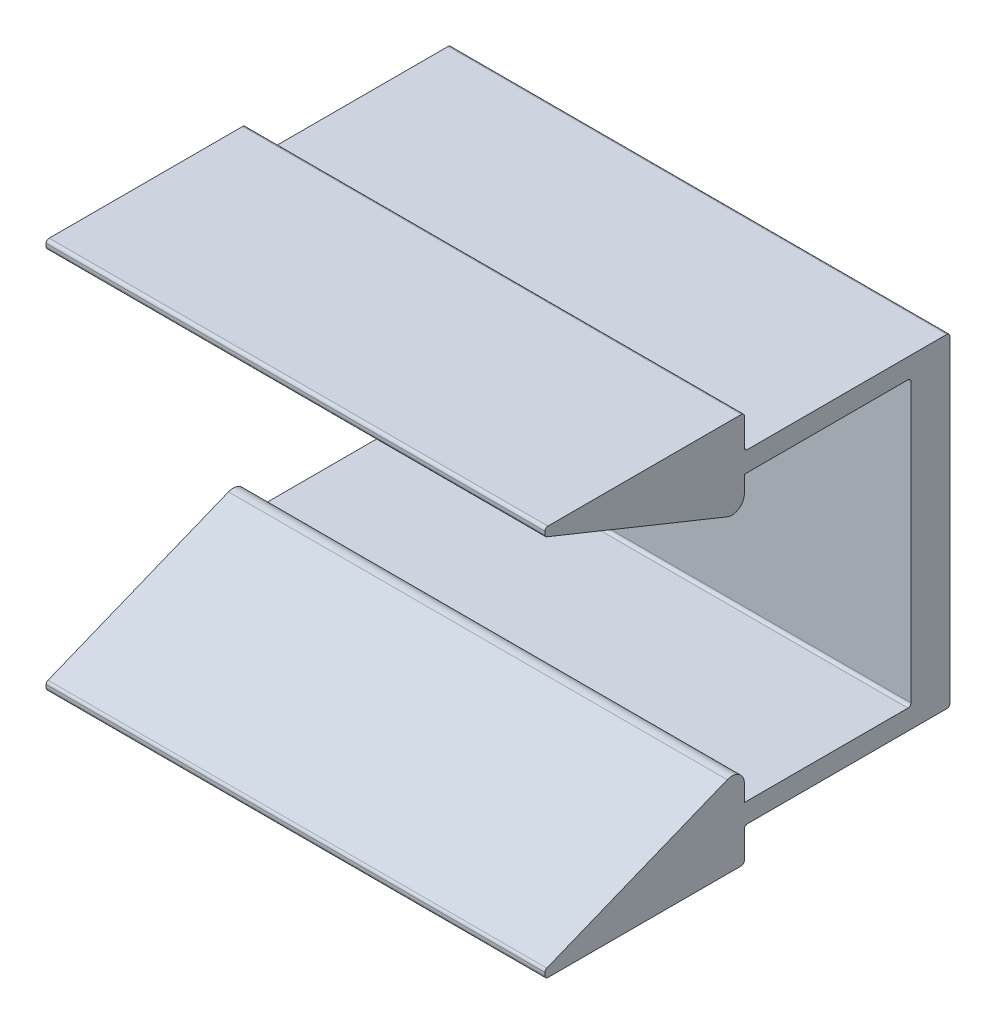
ISO-10303-21;
HEADER;
FILE_DESCRIPTION(('STEP AP214'),'2;1');
FILE_NAME('part.step','',(''),(''),'','','');
FILE_SCHEMA(('AUTOMOTIVE_DESIGN { 1 0 10303 214 1 1 1 1 }'));
ENDSEC;
DATA;
#1=APPLICATION_CONTEXT('core data for automotive mechanical design processes');
#2=APPLICATION_PROTOCOL_DEFINITION('international standard','automotive_design',2000,#1);
#3=PRODUCT_CONTEXT('',#1,'mechanical');
#4=PRODUCT('Part','Part','',(#3));
#5=PRODUCT_RELATED_PRODUCT_CATEGORY('part','',(#4));
#6=PRODUCT_DEFINITION_FORMATION('','',#4);
#7=PRODUCT_DEFINITION_CONTEXT('part definition',#1,'design');
#8=PRODUCT_DEFINITION('design','',#6,#7);
#9=PRODUCT_DEFINITION_SHAPE('','',#8);
#10=(LENGTH_UNIT() NAMED_UNIT(*) SI_UNIT(.MILLI.,.METRE.));
#11=(NAMED_UNIT(*) PLANE_ANGLE_UNIT() SI_UNIT($,.RADIAN.));
#12=(NAMED_UNIT(*) SI_UNIT($,.STERADIAN.) SOLID_ANGLE_UNIT());
#13=UNCERTAINTY_MEASURE_WITH_UNIT(LENGTH_MEASURE(1.E-05),#10,'distance_accuracy_value','');
#14=(GEOMETRIC_REPRESENTATION_CONTEXT(3) GLOBAL_UNCERTAINTY_ASSIGNED_CONTEXT((#13)) GLOBAL_UNIT_ASSIGNED_CONTEXT((#10,
#11,#12)) REPRESENTATION_CONTEXT('',''));
#15=CARTESIAN_POINT('',(0.,0.,0.));
#16=DIRECTION('',(0.,0.,1.));
#17=DIRECTION('',(1.,0.,0.));
#18=AXIS2_PLACEMENT_3D('',#15,#16,#17);
#19=CARTESIAN_POINT('',(31.75,17.7165,4.953));
#20=DIRECTION('',(0.,0.,-1.));
#21=DIRECTION('',(-1.,0.,0.));
#22=AXIS2_PLACEMENT_3D('',#19,#20,#21);
#23=PLANE('',#22);
#24=DIRECTION('',(0.,-1.,0.));
#25=VECTOR('',#24,1.);
#26=CARTESIAN_POINT('',(-31.75,17.7165,4.953));
#27=LINE('',#26,#25);
#28=CARTESIAN_POINT('',(-31.75,17.7165,4.953));
#29=VERTEX_POINT('',#28);
#30=CARTESIAN_POINT('',(-31.75,-17.7165,4.953));
#31=VERTEX_POINT('',#30);
#32=EDGE_CURVE('E218',#29,#31,#27,.T.);
#33=ORIENTED_EDGE('',*,*,#32,.T.);
#34=DIRECTION('',(-1.,0.,0.));
#35=VECTOR('',#34,1.);
#36=CARTESIAN_POINT('',(31.75,-17.7165,4.953));
#37=LINE('',#36,#35);
#38=CARTESIAN_POINT('',(31.75,-17.7165,4.953));
#39=VERTEX_POINT('',#38);
#40=EDGE_CURVE('E426',#39,#31,#37,.T.);
#41=ORIENTED_EDGE('',*,*,#40,.F.);
#42=DIRECTION('',(0.,-1.,0.));
#43=VECTOR('',#42,1.);
#44=CARTESIAN_POINT('',(31.75,17.7165,4.953));
#45=LINE('',#44,#43);
#46=CARTESIAN_POINT('',(31.75,17.7165,4.953));
#47=VERTEX_POINT('',#46);
#48=EDGE_CURVE('E293',#47,#39,#45,.T.);
#49=ORIENTED_EDGE('',*,*,#48,.F.);
#50=DIRECTION('',(-1.,0.,0.));
#51=VECTOR('',#50,1.);
#52=CARTESIAN_POINT('',(31.75,17.7165,4.953));
#53=LINE('',#52,#51);
#54=EDGE_CURVE('E23',#47,#29,#53,.T.);
#55=ORIENTED_EDGE('',*,*,#54,.T.);
#56=EDGE_LOOP('',(#33,#41,#49,#55));
#57=FACE_BOUND('',#56,.T.);
#58=CARTESIAN_POINT('',(0.,0.,4.953));
#59=DIRECTION('',(0.,0.,-1.));
#60=DIRECTION('',(-1.,0.,0.));
#61=AXIS2_PLACEMENT_3D('',#58,#59,#60);
#62=CIRCLE('',#61,8.255);
#63=CARTESIAN_POINT('',(-8.255,0.,4.953));
#64=VERTEX_POINT('',#63);
#65=EDGE_CURVE('E230',#64,#64,#62,.F.);
#66=ORIENTED_EDGE('',*,*,#65,.F.);
#67=EDGE_LOOP('',(#66));
#68=FACE_BOUND('',#67,.T.);
#69=ADVANCED_FACE('F14',(#57,#68),#23,.F.);
#70=CARTESIAN_POINT('',(31.75,-20.2565,0.));
#71=DIRECTION('',(0.,0.,1.));
#72=DIRECTION('',(1.,0.,0.));
#73=AXIS2_PLACEMENT_3D('',#70,#71,#72);
#74=PLANE('',#73);
#75=DIRECTION('',(0.,1.,0.));
#76=VECTOR('',#75,1.);
#77=CARTESIAN_POINT('',(-31.75,-20.2565,0.));
#78=LINE('',#77,#76);
#79=CARTESIAN_POINT('',(-31.75,-20.2565,0.));
#80=VERTEX_POINT('',#79);
#81=CARTESIAN_POINT('',(-31.75,20.2565,0.));
#82=VERTEX_POINT('',#81);
#83=EDGE_CURVE('E264',#80,#82,#78,.T.);
#84=ORIENTED_EDGE('',*,*,#83,.T.);
#85=DIRECTION('',(-1.,0.,0.));
#86=VECTOR('',#85,1.);
#87=CARTESIAN_POINT('',(31.75,20.2565,0.));
#88=LINE('',#87,#86);
#89=CARTESIAN_POINT('',(31.75,20.2565,0.));
#90=VERTEX_POINT('',#89);
#91=EDGE_CURVE('E381',#90,#82,#88,.T.);
#92=ORIENTED_EDGE('',*,*,#91,.F.);
#93=DIRECTION('',(0.,1.,0.));
#94=VECTOR('',#93,1.);
#95=CARTESIAN_POINT('',(31.75,-20.2565,0.));
#96=LINE('',#95,#94);
#97=CARTESIAN_POINT('',(31.75,-20.2565,0.));
#98=VERTEX_POINT('',#97);
#99=EDGE_CURVE('E323',#98,#90,#96,.T.);
#100=ORIENTED_EDGE('',*,*,#99,.F.);
#101=DIRECTION('',(-1.,0.,0.));
#102=VECTOR('',#101,1.);
#103=CARTESIAN_POINT('',(31.75,-20.2565,0.));
#104=LINE('',#103,#102);
#105=EDGE_CURVE('E384',#98,#80,#104,.T.);
#106=ORIENTED_EDGE('',*,*,#105,.T.);
#107=EDGE_LOOP('',(#84,#92,#100,#106));
#108=FACE_BOUND('',#107,.T.);
#109=CARTESIAN_POINT('',(0.,0.,0.));
#110=DIRECTION('',(0.,0.,1.));
#111=DIRECTION('',(1.,0.,0.));
#112=AXIS2_PLACEMENT_3D('',#109,#110,#111);
#113=CIRCLE('',#112,8.255);
#114=CARTESIAN_POINT('',(8.255,0.,0.));
#115=VERTEX_POINT('',#114);
#116=EDGE_CURVE('E18',#115,#115,#113,.F.);
#117=ORIENTED_EDGE('',*,*,#116,.F.);
#118=EDGE_LOOP('',(#117));
#119=FACE_BOUND('',#118,.T.);
#120=ADVANCED_FACE('F507',(#108,#119),#74,.F.);
#121=CARTESIAN_POINT('',(31.75,18.0975,26.162));
#122=DIRECTION('',(0.,1.,0.));
#123=DIRECTION('',(0.,0.,1.));
#124=AXIS2_PLACEMENT_3D('',#121,#122,#123);
#125=PLANE('',#124);
#126=DIRECTION('',(0.,0.,-1.));
#127=VECTOR('',#126,1.);
#128=CARTESIAN_POINT('',(-31.75,18.0975,26.162));
#129=LINE('',#128,#127);
#130=CARTESIAN_POINT('',(-31.75,18.0975,26.162));
#131=VERTEX_POINT('',#130);
#132=CARTESIAN_POINT('',(-31.75,18.0975,5.334));
#133=VERTEX_POINT('',#132);
#134=EDGE_CURVE('E216',#131,#133,#129,.T.);
#135=ORIENTED_EDGE('',*,*,#134,.T.);
#136=DIRECTION('',(-1.,0.,0.));
#137=VECTOR('',#136,1.);
#138=CARTESIAN_POINT('',(31.75,18.0975,5.334));
#139=LINE('',#138,#137);
#140=CARTESIAN_POINT('',(31.75,18.0975,5.334));
#141=VERTEX_POINT('',#140);
#142=EDGE_CURVE('E9',#141,#133,#139,.T.);
#143=ORIENTED_EDGE('',*,*,#142,.F.);
#144=DIRECTION('',(0.,0.,-1.));
#145=VECTOR('',#144,1.);
#146=CARTESIAN_POINT('',(31.75,18.0975,26.162));
#147=LINE('',#146,#145);
#148=CARTESIAN_POINT('',(31.75,18.0975,26.162));
#149=VERTEX_POINT('',#148);
#150=EDGE_CURVE('E290',#149,#141,#147,.T.);
#151=ORIENTED_EDGE('',*,*,#150,.F.);
#152=DIRECTION('',(-1.,0.,0.));
#153=VECTOR('',#152,1.);
#154=CARTESIAN_POINT('',(31.75,18.0975,26.162));
#155=LINE('',#154,#153);
#156=EDGE_CURVE('E229',#149,#131,#155,.T.);
#157=ORIENTED_EDGE('',*,*,#156,.T.);
#158=EDGE_LOOP('',(#135,#143,#151,#157));
#159=FACE_BOUND('',#158,.T.);
#160=ADVANCED_FACE('F16',(#159),#125,.F.);
#161=CARTESIAN_POINT('',(31.75,17.7165,5.334));
#162=DIRECTION('',(-1.,0.,0.));
#163=DIRECTION('',(0.,-1.,0.));
#164=AXIS2_PLACEMENT_3D('',#161,#162,#163);
#165=CYLINDRICAL_SURFACE('',#164,0.381);
#166=CARTESIAN_POINT('',(-31.75,17.7165,5.334));
#167=DIRECTION('',(-1.,0.,0.));
#168=DIRECTION('',(0.,-1.,0.));
#169=AXIS2_PLACEMENT_3D('',#166,#167,#168);
#170=CIRCLE('',#169,0.381);
#171=EDGE_CURVE('E212',#133,#29,#170,.T.);
#172=ORIENTED_EDGE('',*,*,#171,.T.);
#173=ORIENTED_EDGE('',*,*,#54,.F.);
#174=CARTESIAN_POINT('',(31.75,17.7165,5.334));
#175=DIRECTION('',(-1.,0.,0.));
#176=DIRECTION('',(0.,-1.,0.));
#177=AXIS2_PLACEMENT_3D('',#174,#175,#176);
#178=CIRCLE('',#177,0.381);
#179=EDGE_CURVE('E225',#141,#47,#178,.T.);
#180=ORIENTED_EDGE('',*,*,#179,.F.);
#181=ORIENTED_EDGE('',*,*,#142,.T.);
#182=EDGE_LOOP('',(#172,#173,#180,#181));
#183=FACE_BOUND('',#182,.T.);
#184=ADVANCED_FACE('F224',(#183),#165,.F.);
#185=CARTESIAN_POINT('',(31.75,-17.7165,5.334));
#186=DIRECTION('',(-1.,0.,0.));
#187=DIRECTION('',(0.,-1.,0.));
#188=AXIS2_PLACEMENT_3D('',#185,#186,#187);
#189=CYLINDRICAL_SURFACE('',#188,0.381);
#190=CARTESIAN_POINT('',(-31.75,-17.7165,5.334));
#191=DIRECTION('',(-1.,0.,0.));
#192=DIRECTION('',(0.,1.,0.));
#193=AXIS2_PLACEMENT_3D('',#190,#191,#192);
#194=CIRCLE('',#193,0.381);
#195=CARTESIAN_POINT('',(-31.75,-18.0975,5.334));
#196=VERTEX_POINT('',#195);
#197=EDGE_CURVE('E236',#31,#196,#194,.T.);
#198=ORIENTED_EDGE('',*,*,#197,.T.);
#199=DIRECTION('',(-1.,0.,0.));
#200=VECTOR('',#199,1.);
#201=CARTESIAN_POINT('',(31.75,-18.0975,5.334));
#202=LINE('',#201,#200);
#203=CARTESIAN_POINT('',(31.75,-18.0975,5.334));
#204=VERTEX_POINT('',#203);
#205=EDGE_CURVE('E423',#204,#196,#202,.T.);
#206=ORIENTED_EDGE('',*,*,#205,.F.);
#207=CARTESIAN_POINT('',(31.75,-17.7165,5.334));
#208=DIRECTION('',(-1.,0.,0.));
#209=DIRECTION('',(0.,1.,0.));
#210=AXIS2_PLACEMENT_3D('',#207,#208,#209);
#211=CIRCLE('',#210,0.381);
#212=EDGE_CURVE('E295',#39,#204,#211,.T.);
#213=ORIENTED_EDGE('',*,*,#212,.F.);
#214=ORIENTED_EDGE('',*,*,#40,.T.);
#215=EDGE_LOOP('',(#198,#206,#213,#214));
#216=FACE_BOUND('',#215,.T.);
#217=ADVANCED_FACE('F439',(#216),#189,.F.);
#218=CARTESIAN_POINT('',(31.75,-18.0975,26.162));
#219=DIRECTION('',(0.,-1.,0.));
#220=DIRECTION('',(0.,0.,-1.));
#221=AXIS2_PLACEMENT_3D('',#218,#219,#220);
#222=PLANE('',#221);
#223=DIRECTION('',(0.,0.,1.));
#224=VECTOR('',#223,1.);
#225=CARTESIAN_POINT('',(-31.75,-18.0975,26.162));
#226=LINE('',#225,#224);
#227=CARTESIAN_POINT('',(-31.75,-18.0975,26.162));
#228=VERTEX_POINT('',#227);
#229=EDGE_CURVE('E238',#196,#228,#226,.T.);
#230=ORIENTED_EDGE('',*,*,#229,.T.);
#231=DIRECTION('',(-1.,0.,0.));
#232=VECTOR('',#231,1.);
#233=CARTESIAN_POINT('',(31.75,-18.0975,26.162));
#234=LINE('',#233,#232);
#235=CARTESIAN_POINT('',(31.75,-18.0975,26.162));
#236=VERTEX_POINT('',#235);
#237=EDGE_CURVE('E420',#236,#228,#234,.T.);
#238=ORIENTED_EDGE('',*,*,#237,.F.);
#239=DIRECTION('',(0.,0.,1.));
#240=VECTOR('',#239,1.);
#241=CARTESIAN_POINT('',(31.75,-18.0975,26.162));
#242=LINE('',#241,#240);
#243=EDGE_CURVE('E297',#204,#236,#242,.T.);
#244=ORIENTED_EDGE('',*,*,#243,.F.);
#245=ORIENTED_EDGE('',*,*,#205,.T.);
#246=EDGE_LOOP('',(#230,#238,#244,#245));
#247=FACE_BOUND('',#246,.T.);
#248=ADVANCED_FACE('F442',(#247),#222,.F.);
#249=CARTESIAN_POINT('',(31.75,-15.9672994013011,26.162));
#250=DIRECTION('',(0.,0.,1.));
#251=DIRECTION('',(1.,0.,0.));
#252=AXIS2_PLACEMENT_3D('',#249,#250,#251);
#253=PLANE('',#252);
#254=DIRECTION('',(0.,1.,0.));
#255=VECTOR('',#254,1.);
#256=CARTESIAN_POINT('',(-31.75,-15.9672994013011,26.162));
#257=LINE('',#256,#255);
#258=CARTESIAN_POINT('',(-31.75,-15.9672994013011,26.162));
#259=VERTEX_POINT('',#258);
#260=EDGE_CURVE('E240',#228,#259,#257,.T.);
#261=ORIENTED_EDGE('',*,*,#260,.T.);
#262=DIRECTION('',(-1.,0.,0.));
#263=VECTOR('',#262,1.);
#264=CARTESIAN_POINT('',(31.75,-15.9672994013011,26.162));
#265=LINE('',#264,#263);
#266=CARTESIAN_POINT('',(31.75,-15.9672994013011,26.162));
#267=VERTEX_POINT('',#266);
#268=EDGE_CURVE('E417',#267,#259,#265,.T.);
#269=ORIENTED_EDGE('',*,*,#268,.F.);
#270=DIRECTION('',(0.,1.,0.));
#271=VECTOR('',#270,1.);
#272=CARTESIAN_POINT('',(31.75,-15.9672994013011,26.162));
#273=LINE('',#272,#271);
#274=EDGE_CURVE('E299',#236,#267,#273,.T.);
#275=ORIENTED_EDGE('',*,*,#274,.F.);
#276=ORIENTED_EDGE('',*,*,#237,.T.);
#277=EDGE_LOOP('',(#261,#269,#275,#276));
#278=FACE_BOUND('',#277,.T.);
#279=ADVANCED_FACE('F447',(#278),#253,.F.);
#280=CARTESIAN_POINT('',(31.75,-15.9672994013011,27.7495));
#281=DIRECTION('',(-1.,0.,0.));
#282=DIRECTION('',(0.,-1.,0.));
#283=AXIS2_PLACEMENT_3D('',#280,#281,#282);
#284=CYLINDRICAL_SURFACE('',#283,1.5875);
#285=CARTESIAN_POINT('',(-31.75,-15.9672994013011,27.7495));
#286=DIRECTION('',(1.,0.,0.));
#287=DIRECTION('',(0.,-1.,0.));
#288=AXIS2_PLACEMENT_3D('',#285,#286,#287);
#289=CIRCLE('',#288,1.5875);
#290=CARTESIAN_POINT('',(-31.75,-14.4953950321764,28.3441879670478));
#291=VERTEX_POINT('',#290);
#292=EDGE_CURVE('E242',#259,#291,#289,.T.);
#293=ORIENTED_EDGE('',*,*,#292,.T.);
#294=DIRECTION('',(-1.,0.,0.));
#295=VECTOR('',#294,1.);
#296=CARTESIAN_POINT('',(31.75,-14.4953950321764,28.3441879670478));
#297=LINE('',#296,#295);
#298=CARTESIAN_POINT('',(31.75,-14.4953950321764,28.3441879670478));
#299=VERTEX_POINT('',#298);
#300=EDGE_CURVE('E414',#299,#291,#297,.T.);
#301=ORIENTED_EDGE('',*,*,#300,.F.);
#302=CARTESIAN_POINT('',(31.75,-15.9672994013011,27.7495));
#303=DIRECTION('',(1.,0.,0.));
#304=DIRECTION('',(0.,-1.,0.));
#305=AXIS2_PLACEMENT_3D('',#302,#303,#304);
#306=CIRCLE('',#305,1.5875);
#307=EDGE_CURVE('E301',#267,#299,#306,.T.);
#308=ORIENTED_EDGE('',*,*,#307,.F.);
#309=ORIENTED_EDGE('',*,*,#268,.T.);
#310=EDGE_LOOP('',(#293,#301,#308,#309));
#311=FACE_BOUND('',#310,.T.);
#312=ADVANCED_FACE('F453',(#311),#284,.T.);
#313=CARTESIAN_POINT('',(31.75,-23.779730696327,51.3237251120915));
#314=DIRECTION('',(0.,-0.92718385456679,-0.374606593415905));
#315=DIRECTION('',(0.,0.374606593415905,-0.92718385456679));
#316=AXIS2_PLACEMENT_3D('',#313,#314,#315);
#317=PLANE('',#316);
#318=DIRECTION('',(0.,-0.374606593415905,0.92718385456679));
#319=VECTOR('',#318,1.);
#320=CARTESIAN_POINT('',(-31.75,-23.779730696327,51.3237251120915));
#321=LINE('',#320,#319);
#322=CARTESIAN_POINT('',(-31.75,-23.779730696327,51.3237251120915));
#323=VERTEX_POINT('',#322);
#324=EDGE_CURVE('E244',#291,#323,#321,.T.);
#325=ORIENTED_EDGE('',*,*,#324,.T.);
#326=DIRECTION('',(-1.,0.,0.));
#327=VECTOR('',#326,1.);
#328=CARTESIAN_POINT('',(31.75,-23.779730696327,51.3237251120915));
#329=LINE('',#328,#327);
#330=CARTESIAN_POINT('',(31.75,-23.779730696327,51.3237251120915));
#331=VERTEX_POINT('',#330);
#332=EDGE_CURVE('E411',#331,#323,#329,.T.);
#333=ORIENTED_EDGE('',*,*,#332,.F.);
#334=DIRECTION('',(0.,-0.374606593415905,0.92718385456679));
#335=VECTOR('',#334,1.);
#336=CARTESIAN_POINT('',(31.75,-23.779730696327,51.3237251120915));
#337=LINE('',#336,#335);
#338=EDGE_CURVE('E303',#299,#331,#337,.T.);
#339=ORIENTED_EDGE('',*,*,#338,.F.);
#340=ORIENTED_EDGE('',*,*,#300,.T.);
#341=EDGE_LOOP('',(#325,#333,#339,#340));
#342=FACE_BOUND('',#341,.T.);
#343=ADVANCED_FACE('F457',(#342),#317,.F.);
#344=CARTESIAN_POINT('',(31.75,-24.1329877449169,51.181));
#345=DIRECTION('',(-1.,0.,0.));
#346=DIRECTION('',(0.,-1.,0.));
#347=AXIS2_PLACEMENT_3D('',#344,#345,#346);
#348=CYLINDRICAL_SURFACE('',#347,0.381);
#349=CARTESIAN_POINT('',(-31.75,-24.1329877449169,51.181));
#350=DIRECTION('',(1.,0.,0.));
#351=DIRECTION('',(0.,-1.,0.));
#352=AXIS2_PLACEMENT_3D('',#349,#350,#351);
#353=CIRCLE('',#352,0.381);
#354=CARTESIAN_POINT('',(-31.75,-24.1329877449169,51.562));
#355=VERTEX_POINT('',#354);
#356=EDGE_CURVE('E246',#323,#355,#353,.T.);
#357=ORIENTED_EDGE('',*,*,#356,.T.);
#358=DIRECTION('',(-1.,0.,0.));
#359=VECTOR('',#358,1.);
#360=CARTESIAN_POINT('',(31.75,-24.1329877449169,51.562));
#361=LINE('',#360,#359);
#362=CARTESIAN_POINT('',(31.75,-24.1329877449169,51.562));
#363=VERTEX_POINT('',#362);
#364=EDGE_CURVE('E408',#363,#355,#361,.T.);
#365=ORIENTED_EDGE('',*,*,#364,.F.);
#366=CARTESIAN_POINT('',(31.75,-24.1329877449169,51.181));
#367=DIRECTION('',(1.,0.,0.));
#368=DIRECTION('',(0.,-1.,0.));
#369=AXIS2_PLACEMENT_3D('',#366,#367,#368);
#370=CIRCLE('',#369,0.381);
#371=EDGE_CURVE('E305',#331,#363,#370,.T.);
#372=ORIENTED_EDGE('',*,*,#371,.F.);
#373=ORIENTED_EDGE('',*,*,#332,.T.);
#374=EDGE_LOOP('',(#357,#365,#372,#373));
#375=FACE_BOUND('',#374,.T.);
#376=ADVANCED_FACE('F462',(#375),#348,.T.);
#377=CARTESIAN_POINT('',(31.75,-24.511,51.562));
#378=DIRECTION('',(0.,0.,-1.));
#379=DIRECTION('',(-1.,0.,0.));
#380=AXIS2_PLACEMENT_3D('',#377,#378,#379);
#381=PLANE('',#380);
#382=DIRECTION('',(0.,-1.,0.));
#383=VECTOR('',#382,1.);
#384=CARTESIAN_POINT('',(-31.75,-24.511,51.562));
#385=LINE('',#384,#383);
#386=CARTESIAN_POINT('',(-31.75,-24.511,51.562));
#387=VERTEX_POINT('',#386);
#388=EDGE_CURVE('E248',#355,#387,#385,.T.);
#389=ORIENTED_EDGE('',*,*,#388,.T.);
#390=DIRECTION('',(-1.,0.,0.));
#391=VECTOR('',#390,1.);
#392=CARTESIAN_POINT('',(31.75,-24.511,51.562));
#393=LINE('',#392,#391);
#394=CARTESIAN_POINT('',(31.75,-24.511,51.562));
#395=VERTEX_POINT('',#394);
#396=EDGE_CURVE('E405',#395,#387,#393,.T.);
#397=ORIENTED_EDGE('',*,*,#396,.F.);
#398=DIRECTION('',(0.,-1.,0.));
#399=VECTOR('',#398,1.);
#400=CARTESIAN_POINT('',(31.75,-24.511,51.562));
#401=LINE('',#400,#399);
#402=EDGE_CURVE('E307',#363,#395,#401,.T.);
#403=ORIENTED_EDGE('',*,*,#402,.F.);
#404=ORIENTED_EDGE('',*,*,#364,.T.);
#405=EDGE_LOOP('',(#389,#397,#403,#404));
#406=FACE_BOUND('',#405,.T.);
#407=ADVANCED_FACE('F468',(#406),#381,.F.);
#408=CARTESIAN_POINT('',(31.75,-24.511,51.181));
#409=DIRECTION('',(-1.,0.,0.));
#410=DIRECTION('',(0.,-1.,0.));
#411=AXIS2_PLACEMENT_3D('',#408,#409,#410);
#412=CYLINDRICAL_SURFACE('',#411,0.381);
#413=CARTESIAN_POINT('',(-31.75,-24.511,51.181));
#414=DIRECTION('',(1.,0.,0.));
#415=DIRECTION('',(0.,-1.,0.));
#416=AXIS2_PLACEMENT_3D('',#413,#414,#415);
#417=CIRCLE('',#416,0.381);
#418=CARTESIAN_POINT('',(-31.75,-24.892,51.181));
#419=VERTEX_POINT('',#418);
#420=EDGE_CURVE('E250',#387,#419,#417,.T.);
#421=ORIENTED_EDGE('',*,*,#420,.T.);
#422=DIRECTION('',(-1.,0.,0.));
#423=VECTOR('',#422,1.);
#424=CARTESIAN_POINT('',(31.75,-24.892,51.181));
#425=LINE('',#424,#423);
#426=CARTESIAN_POINT('',(31.75,-24.892,51.181));
#427=VERTEX_POINT('',#426);
#428=EDGE_CURVE('E402',#427,#419,#425,.T.);
#429=ORIENTED_EDGE('',*,*,#428,.F.);
#430=CARTESIAN_POINT('',(31.75,-24.511,51.181));
#431=DIRECTION('',(1.,0.,0.));
#432=DIRECTION('',(0.,-1.,0.));
#433=AXIS2_PLACEMENT_3D('',#430,#431,#432);
#434=CIRCLE('',#433,0.381);
#435=EDGE_CURVE('E309',#395,#427,#434,.T.);
#436=ORIENTED_EDGE('',*,*,#435,.F.);
#437=ORIENTED_EDGE('',*,*,#396,.T.);
#438=EDGE_LOOP('',(#421,#429,#436,#437));
#439=FACE_BOUND('',#438,.T.);
#440=ADVANCED_FACE('F472',(#439),#412,.T.);
#441=CARTESIAN_POINT('',(31.75,-24.892,26.543));
#442=DIRECTION('',(0.,1.,0.));
#443=DIRECTION('',(-1.,0.,0.));
#444=AXIS2_PLACEMENT_3D('',#441,#442,#443);
#445=PLANE('',#444);
#446=DIRECTION('',(0.,0.,-1.));
#447=VECTOR('',#446,1.);
#448=CARTESIAN_POINT('',(-31.75,-24.892,26.543));
#449=LINE('',#448,#447);
#450=CARTESIAN_POINT('',(-31.75,-24.892,26.543));
#451=VERTEX_POINT('',#450);
#452=EDGE_CURVE('E252',#419,#451,#449,.T.);
#453=ORIENTED_EDGE('',*,*,#452,.T.);
#454=DIRECTION('',(-1.,0.,0.));
#455=VECTOR('',#454,1.);
#456=CARTESIAN_POINT('',(31.75,-24.892,26.543));
#457=LINE('',#456,#455);
#458=CARTESIAN_POINT('',(31.75,-24.892,26.543));
#459=VERTEX_POINT('',#458);
#460=EDGE_CURVE('E399',#459,#451,#457,.T.);
#461=ORIENTED_EDGE('',*,*,#460,.F.);
#462=DIRECTION('',(0.,0.,-1.));
#463=VECTOR('',#462,1.);
#464=CARTESIAN_POINT('',(31.75,-24.892,26.543));
#465=LINE('',#464,#463);
#466=EDGE_CURVE('E311',#427,#459,#465,.T.);
#467=ORIENTED_EDGE('',*,*,#466,.F.);
#468=ORIENTED_EDGE('',*,*,#428,.T.);
#469=EDGE_LOOP('',(#453,#461,#467,#468));
#470=FACE_BOUND('',#469,.T.);
#471=ADVANCED_FACE('F477',(#470),#445,.F.);
#472=CARTESIAN_POINT('',(31.75,-24.511,26.543));
#473=DIRECTION('',(-1.,0.,0.));
#474=DIRECTION('',(0.,-1.,0.));
#475=AXIS2_PLACEMENT_3D('',#472,#473,#474);
#476=CYLINDRICAL_SURFACE('',#475,0.381);
#477=CARTESIAN_POINT('',(-31.75,-24.511,26.543));
#478=DIRECTION('',(1.,0.,0.));
#479=DIRECTION('',(0.,-1.,0.));
#480=AXIS2_PLACEMENT_3D('',#477,#478,#479);
#481=CIRCLE('',#480,0.381);
#482=CARTESIAN_POINT('',(-31.75,-24.511,26.162));
#483=VERTEX_POINT('',#482);
#484=EDGE_CURVE('E254',#451,#483,#481,.T.);
#485=ORIENTED_EDGE('',*,*,#484,.T.);
#486=DIRECTION('',(-1.,0.,0.));
#487=VECTOR('',#486,1.);
#488=CARTESIAN_POINT('',(31.75,-24.511,26.162));
#489=LINE('',#488,#487);
#490=CARTESIAN_POINT('',(31.75,-24.511,26.162));
#491=VERTEX_POINT('',#490);
#492=EDGE_CURVE('E396',#491,#483,#489,.T.);
#493=ORIENTED_EDGE('',*,*,#492,.F.);
#494=CARTESIAN_POINT('',(31.75,-24.511,26.543));
#495=DIRECTION('',(1.,0.,0.));
#496=DIRECTION('',(0.,-1.,0.));
#497=AXIS2_PLACEMENT_3D('',#494,#495,#496);
#498=CIRCLE('',#497,0.381);
#499=EDGE_CURVE('E313',#459,#491,#498,.T.);
#500=ORIENTED_EDGE('',*,*,#499,.F.);
#501=ORIENTED_EDGE('',*,*,#460,.T.);
#502=EDGE_LOOP('',(#485,#493,#500,#501));
#503=FACE_BOUND('',#502,.T.);
#504=ADVANCED_FACE('F483',(#503),#476,.T.);
#505=CARTESIAN_POINT('',(31.75,-21.0185,26.162));
#506=DIRECTION('',(0.,0.,1.));
#507=DIRECTION('',(1.,0.,0.));
#508=AXIS2_PLACEMENT_3D('',#505,#506,#507);
#509=PLANE('',#508);
#510=DIRECTION('',(0.,1.,0.));
#511=VECTOR('',#510,1.);
#512=CARTESIAN_POINT('',(-31.75,-21.0185,26.162));
#513=LINE('',#512,#511);
#514=CARTESIAN_POINT('',(-31.75,-21.0185,26.162));
#515=VERTEX_POINT('',#514);
#516=EDGE_CURVE('E256',#483,#515,#513,.T.);
#517=ORIENTED_EDGE('',*,*,#516,.T.);
#518=DIRECTION('',(-1.,0.,0.));
#519=VECTOR('',#518,1.);
#520=CARTESIAN_POINT('',(31.75,-21.0185,26.162));
#521=LINE('',#520,#519);
#522=CARTESIAN_POINT('',(31.75,-21.0185,26.162));
#523=VERTEX_POINT('',#522);
#524=EDGE_CURVE('E393',#523,#515,#521,.T.);
#525=ORIENTED_EDGE('',*,*,#524,.F.);
#526=DIRECTION('',(0.,1.,0.));
#527=VECTOR('',#526,1.);
#528=CARTESIAN_POINT('',(31.75,-21.0185,26.162));
#529=LINE('',#528,#527);
#530=EDGE_CURVE('E315',#491,#523,#529,.T.);
#531=ORIENTED_EDGE('',*,*,#530,.F.);
#532=ORIENTED_EDGE('',*,*,#492,.T.);
#533=EDGE_LOOP('',(#517,#525,#531,#532));
#534=FACE_BOUND('',#533,.T.);
#535=ADVANCED_FACE('F487',(#534),#509,.F.);
#536=CARTESIAN_POINT('',(31.75,-21.0185,25.781));
#537=DIRECTION('',(-1.,0.,0.));
#538=DIRECTION('',(0.,-1.,0.));
#539=AXIS2_PLACEMENT_3D('',#536,#537,#538);
#540=CYLINDRICAL_SURFACE('',#539,0.381);
#541=CARTESIAN_POINT('',(-31.75,-21.0185,25.781));
#542=DIRECTION('',(-1.,0.,0.));
#543=DIRECTION('',(0.,1.,0.));
#544=AXIS2_PLACEMENT_3D('',#541,#542,#543);
#545=CIRCLE('',#544,0.381);
#546=CARTESIAN_POINT('',(-31.75,-20.6375,25.781));
#547=VERTEX_POINT('',#546);
#548=EDGE_CURVE('E258',#515,#547,#545,.T.);
#549=ORIENTED_EDGE('',*,*,#548,.T.);
#550=DIRECTION('',(-1.,0.,0.));
#551=VECTOR('',#550,1.);
#552=CARTESIAN_POINT('',(31.75,-20.6375,25.781));
#553=LINE('',#552,#551);
#554=CARTESIAN_POINT('',(31.75,-20.6375,25.781));
#555=VERTEX_POINT('',#554);
#556=EDGE_CURVE('E390',#555,#547,#553,.T.);
#557=ORIENTED_EDGE('',*,*,#556,.F.);
#558=CARTESIAN_POINT('',(31.75,-21.0185,25.781));
#559=DIRECTION('',(-1.,0.,0.));
#560=DIRECTION('',(0.,1.,0.));
#561=AXIS2_PLACEMENT_3D('',#558,#559,#560);
#562=CIRCLE('',#561,0.381);
#563=EDGE_CURVE('E317',#523,#555,#562,.T.);
#564=ORIENTED_EDGE('',*,*,#563,.F.);
#565=ORIENTED_EDGE('',*,*,#524,.T.);
#566=EDGE_LOOP('',(#549,#557,#564,#565));
#567=FACE_BOUND('',#566,.T.);
#568=ADVANCED_FACE('F492',(#567),#540,.F.);
#569=CARTESIAN_POINT('',(31.75,-20.6375,0.381));
#570=DIRECTION('',(0.,1.,0.));
#571=DIRECTION('',(-1.,0.,0.));
#572=AXIS2_PLACEMENT_3D('',#569,#570,#571);
#573=PLANE('',#572);
#574=DIRECTION('',(0.,0.,-1.));
#575=VECTOR('',#574,1.);
#576=CARTESIAN_POINT('',(-31.75,-20.6375,0.381));
#577=LINE('',#576,#575);
#578=CARTESIAN_POINT('',(-31.75,-20.6375,0.381));
#579=VERTEX_POINT('',#578);
#580=EDGE_CURVE('E260',#547,#579,#577,.T.);
#581=ORIENTED_EDGE('',*,*,#580,.T.);
#582=DIRECTION('',(-1.,0.,0.));
#583=VECTOR('',#582,1.);
#584=CARTESIAN_POINT('',(31.75,-20.6375,0.381));
#585=LINE('',#584,#583);
#586=CARTESIAN_POINT('',(31.75,-20.6375,0.381));
#587=VERTEX_POINT('',#586);
#588=EDGE_CURVE('E387',#587,#579,#585,.T.);
#589=ORIENTED_EDGE('',*,*,#588,.F.);
#590=DIRECTION('',(0.,0.,-1.));
#591=VECTOR('',#590,1.);
#592=CARTESIAN_POINT('',(31.75,-20.6375,0.381));
#593=LINE('',#592,#591);
#594=EDGE_CURVE('E319',#555,#587,#593,.T.);
#595=ORIENTED_EDGE('',*,*,#594,.F.);
#596=ORIENTED_EDGE('',*,*,#556,.T.);
#597=EDGE_LOOP('',(#581,#589,#595,#596));
#598=FACE_BOUND('',#597,.T.);
#599=ADVANCED_FACE('F498',(#598),#573,.F.);
#600=CARTESIAN_POINT('',(31.75,-20.2565,0.381));
#601=DIRECTION('',(-1.,0.,0.));
#602=DIRECTION('',(0.,-1.,0.));
#603=AXIS2_PLACEMENT_3D('',#600,#601,#602);
#604=CYLINDRICAL_SURFACE('',#603,0.381);
#605=CARTESIAN_POINT('',(-31.75,-20.2565,0.381));
#606=DIRECTION('',(1.,0.,0.));
#607=DIRECTION('',(0.,-1.,0.));
#608=AXIS2_PLACEMENT_3D('',#605,#606,#607);
#609=CIRCLE('',#608,0.381);
#610=EDGE_CURVE('E262',#579,#80,#609,.T.);
#611=ORIENTED_EDGE('',*,*,#610,.T.);
#612=ORIENTED_EDGE('',*,*,#105,.F.);
#613=CARTESIAN_POINT('',(31.75,-20.2565,0.381));
#614=DIRECTION('',(1.,0.,0.));
#615=DIRECTION('',(0.,-1.,0.));
#616=AXIS2_PLACEMENT_3D('',#613,#614,#615);
#617=CIRCLE('',#616,0.381);
#618=EDGE_CURVE('E321',#587,#98,#617,.T.);
#619=ORIENTED_EDGE('',*,*,#618,.F.);
#620=ORIENTED_EDGE('',*,*,#588,.T.);
#621=EDGE_LOOP('',(#611,#612,#619,#620));
#622=FACE_BOUND('',#621,.T.);
#623=ADVANCED_FACE('F502',(#622),#604,.T.);
#624=CARTESIAN_POINT('',(31.75,20.2565,0.381));
#625=DIRECTION('',(-1.,0.,0.));
#626=DIRECTION('',(0.,-1.,0.));
#627=AXIS2_PLACEMENT_3D('',#624,#625,#626);
#628=CYLINDRICAL_SURFACE('',#627,0.381);
#629=CARTESIAN_POINT('',(-31.75,20.2565,0.381));
#630=DIRECTION('',(1.,0.,0.));
#631=DIRECTION('',(0.,1.,0.));
#632=AXIS2_PLACEMENT_3D('',#629,#630,#631);
#633=CIRCLE('',#632,0.381);
#634=CARTESIAN_POINT('',(-31.75,20.6375,0.381));
#635=VERTEX_POINT('',#634);
#636=EDGE_CURVE('E266',#82,#635,#633,.T.);
#637=ORIENTED_EDGE('',*,*,#636,.T.);
#638=DIRECTION('',(-1.,0.,0.));
#639=VECTOR('',#638,1.);
#640=CARTESIAN_POINT('',(31.75,20.6375,0.381));
#641=LINE('',#640,#639);
#642=CARTESIAN_POINT('',(31.75,20.6375,0.381));
#643=VERTEX_POINT('',#642);
#644=EDGE_CURVE('E378',#643,#635,#641,.T.);
#645=ORIENTED_EDGE('',*,*,#644,.F.);
#646=CARTESIAN_POINT('',(31.75,20.2565,0.381));
#647=DIRECTION('',(1.,0.,0.));
#648=DIRECTION('',(0.,1.,0.));
#649=AXIS2_PLACEMENT_3D('',#646,#647,#648);
#650=CIRCLE('',#649,0.381);
#651=EDGE_CURVE('E325',#90,#643,#650,.T.);
#652=ORIENTED_EDGE('',*,*,#651,.F.);
#653=ORIENTED_EDGE('',*,*,#91,.T.);
#654=EDGE_LOOP('',(#637,#645,#652,#653));
#655=FACE_BOUND('',#654,.T.);
#656=ADVANCED_FACE('F514',(#655),#628,.T.);
#657=CARTESIAN_POINT('',(31.75,20.6375,0.381));
#658=DIRECTION('',(0.,-1.,0.));
#659=DIRECTION('',(1.,0.,0.));
#660=AXIS2_PLACEMENT_3D('',#657,#658,#659);
#661=PLANE('',#660);
#662=DIRECTION('',(0.,0.,1.));
#663=VECTOR('',#662,1.);
#664=CARTESIAN_POINT('',(-31.75,20.6375,0.381));
#665=LINE('',#664,#663);
#666=CARTESIAN_POINT('',(-31.75,20.6375,25.781));
#667=VERTEX_POINT('',#666);
#668=EDGE_CURVE('E268',#635,#667,#665,.T.);
#669=ORIENTED_EDGE('',*,*,#668,.T.);
#670=DIRECTION('',(-1.,0.,0.));
#671=VECTOR('',#670,1.);
#672=CARTESIAN_POINT('',(31.75,20.6375,25.781));
#673=LINE('',#672,#671);
#674=CARTESIAN_POINT('',(31.75,20.6375,25.781));
#675=VERTEX_POINT('',#674);
#676=EDGE_CURVE('E375',#675,#667,#673,.T.);
#677=ORIENTED_EDGE('',*,*,#676,.F.);
#678=DIRECTION('',(0.,0.,1.));
#679=VECTOR('',#678,1.);
#680=CARTESIAN_POINT('',(31.75,20.6375,0.381));
#681=LINE('',#680,#679);
#682=EDGE_CURVE('E327',#643,#675,#681,.T.);
#683=ORIENTED_EDGE('',*,*,#682,.F.);
#684=ORIENTED_EDGE('',*,*,#644,.T.);
#685=EDGE_LOOP('',(#669,#677,#683,#684));
#686=FACE_BOUND('',#685,.T.);
#687=ADVANCED_FACE('F518',(#686),#661,.F.);
#688=CARTESIAN_POINT('',(31.75,21.0185,25.781));
#689=DIRECTION('',(-1.,0.,0.));
#690=DIRECTION('',(0.,-1.,0.));
#691=AXIS2_PLACEMENT_3D('',#688,#689,#690);
#692=CYLINDRICAL_SURFACE('',#691,0.381);
#693=CARTESIAN_POINT('',(-31.75,21.0185,25.781));
#694=DIRECTION('',(-1.,0.,0.));
#695=DIRECTION('',(0.,-1.,0.));
#696=AXIS2_PLACEMENT_3D('',#693,#694,#695);
#697=CIRCLE('',#696,0.381);
#698=CARTESIAN_POINT('',(-31.75,21.0185,26.162));
#699=VERTEX_POINT('',#698);
#700=EDGE_CURVE('E270',#667,#699,#697,.T.);
#701=ORIENTED_EDGE('',*,*,#700,.T.);
#702=DIRECTION('',(-1.,0.,0.));
#703=VECTOR('',#702,1.);
#704=CARTESIAN_POINT('',(31.75,21.0185,26.162));
#705=LINE('',#704,#703);
#706=CARTESIAN_POINT('',(31.75,21.0185,26.162));
#707=VERTEX_POINT('',#706);
#708=EDGE_CURVE('E372',#707,#699,#705,.T.);
#709=ORIENTED_EDGE('',*,*,#708,.F.);
#710=CARTESIAN_POINT('',(31.75,21.0185,25.781));
#711=DIRECTION('',(-1.,0.,0.));
#712=DIRECTION('',(0.,-1.,0.));
#713=AXIS2_PLACEMENT_3D('',#710,#711,#712);
#714=CIRCLE('',#713,0.381);
#715=EDGE_CURVE('E329',#675,#707,#714,.T.);
#716=ORIENTED_EDGE('',*,*,#715,.F.);
#717=ORIENTED_EDGE('',*,*,#676,.T.);
#718=EDGE_LOOP('',(#701,#709,#716,#717));
#719=FACE_BOUND('',#718,.T.);
#720=ADVANCED_FACE('F523',(#719),#692,.F.);
#721=CARTESIAN_POINT('',(31.75,21.0185,26.162));
#722=DIRECTION('',(0.,0.,1.));
#723=DIRECTION('',(1.,0.,0.));
#724=AXIS2_PLACEMENT_3D('',#721,#722,#723);
#725=PLANE('',#724);
#726=DIRECTION('',(0.,1.,0.));
#727=VECTOR('',#726,1.);
#728=CARTESIAN_POINT('',(-31.75,21.0185,26.162));
#729=LINE('',#728,#727);
#730=CARTESIAN_POINT('',(-31.75,24.511,26.162));
#731=VERTEX_POINT('',#730);
#732=EDGE_CURVE('E272',#699,#731,#729,.T.);
#733=ORIENTED_EDGE('',*,*,#732,.T.);
#734=DIRECTION('',(-1.,0.,0.));
#735=VECTOR('',#734,1.);
#736=CARTESIAN_POINT('',(31.75,24.511,26.162));
#737=LINE('',#736,#735);
#738=CARTESIAN_POINT('',(31.75,24.511,26.162));
#739=VERTEX_POINT('',#738);
#740=EDGE_CURVE('E369',#739,#731,#737,.T.);
#741=ORIENTED_EDGE('',*,*,#740,.F.);
#742=DIRECTION('',(0.,1.,0.));
#743=VECTOR('',#742,1.);
#744=CARTESIAN_POINT('',(31.75,21.0185,26.162));
#745=LINE('',#744,#743);
#746=EDGE_CURVE('E331',#707,#739,#745,.T.);
#747=ORIENTED_EDGE('',*,*,#746,.F.);
#748=ORIENTED_EDGE('',*,*,#708,.T.);
#749=EDGE_LOOP('',(#733,#741,#747,#748));
#750=FACE_BOUND('',#749,.T.);
#751=ADVANCED_FACE('F529',(#750),#725,.F.);
#752=CARTESIAN_POINT('',(31.75,24.511,26.543));
#753=DIRECTION('',(-1.,0.,0.));
#754=DIRECTION('',(0.,-1.,0.));
#755=AXIS2_PLACEMENT_3D('',#752,#753,#754);
#756=CYLINDRICAL_SURFACE('',#755,0.381);
#757=CARTESIAN_POINT('',(-31.75,24.511,26.543));
#758=DIRECTION('',(1.,0.,0.));
#759=DIRECTION('',(0.,1.,0.));
#760=AXIS2_PLACEMENT_3D('',#757,#758,#759);
#761=CIRCLE('',#760,0.381);
#762=CARTESIAN_POINT('',(-31.75,24.892,26.543));
#763=VERTEX_POINT('',#762);
#764=EDGE_CURVE('E274',#731,#763,#761,.T.);
#765=ORIENTED_EDGE('',*,*,#764,.T.);
#766=DIRECTION('',(-1.,0.,0.));
#767=VECTOR('',#766,1.);
#768=CARTESIAN_POINT('',(31.75,24.892,26.543));
#769=LINE('',#768,#767);
#770=CARTESIAN_POINT('',(31.75,24.892,26.543));
#771=VERTEX_POINT('',#770);
#772=EDGE_CURVE('E366',#771,#763,#769,.T.);
#773=ORIENTED_EDGE('',*,*,#772,.F.);
#774=CARTESIAN_POINT('',(31.75,24.511,26.543));
#775=DIRECTION('',(1.,0.,0.));
#776=DIRECTION('',(0.,1.,0.));
#777=AXIS2_PLACEMENT_3D('',#774,#775,#776);
#778=CIRCLE('',#777,0.381);
#779=EDGE_CURVE('E333',#739,#771,#778,.T.);
#780=ORIENTED_EDGE('',*,*,#779,.F.);
#781=ORIENTED_EDGE('',*,*,#740,.T.);
#782=EDGE_LOOP('',(#765,#773,#780,#781));
#783=FACE_BOUND('',#782,.T.);
#784=ADVANCED_FACE('F533',(#783),#756,.T.);
#785=CARTESIAN_POINT('',(31.75,24.892,26.543));
#786=DIRECTION('',(0.,-1.,0.));
#787=DIRECTION('',(1.,0.,0.));
#788=AXIS2_PLACEMENT_3D('',#785,#786,#787);
#789=PLANE('',#788);
#790=DIRECTION('',(0.,0.,1.));
#791=VECTOR('',#790,1.);
#792=CARTESIAN_POINT('',(-31.75,24.892,26.543));
#793=LINE('',#792,#791);
#794=CARTESIAN_POINT('',(-31.75,24.892,51.181));
#795=VERTEX_POINT('',#794);
#796=EDGE_CURVE('E276',#763,#795,#793,.T.);
#797=ORIENTED_EDGE('',*,*,#796,.T.);
#798=DIRECTION('',(-1.,0.,0.));
#799=VECTOR('',#798,1.);
#800=CARTESIAN_POINT('',(31.75,24.892,51.181));
#801=LINE('',#800,#799);
#802=CARTESIAN_POINT('',(31.75,24.892,51.181));
#803=VERTEX_POINT('',#802);
#804=EDGE_CURVE('E363',#803,#795,#801,.T.);
#805=ORIENTED_EDGE('',*,*,#804,.F.);
#806=DIRECTION('',(0.,0.,1.));
#807=VECTOR('',#806,1.);
#808=CARTESIAN_POINT('',(31.75,24.892,26.543));
#809=LINE('',#808,#807);
#810=EDGE_CURVE('E335',#771,#803,#809,.T.);
#811=ORIENTED_EDGE('',*,*,#810,.F.);
#812=ORIENTED_EDGE('',*,*,#772,.T.);
#813=EDGE_LOOP('',(#797,#805,#811,#812));
#814=FACE_BOUND('',#813,.T.);
#815=ADVANCED_FACE('F538',(#814),#789,.F.);
#816=CARTESIAN_POINT('',(31.75,24.511,51.181));
#817=DIRECTION('',(-1.,0.,0.));
#818=DIRECTION('',(0.,-1.,0.));
#819=AXIS2_PLACEMENT_3D('',#816,#817,#818);
#820=CYLINDRICAL_SURFACE('',#819,0.381);
#821=CARTESIAN_POINT('',(-31.75,24.511,51.181));
#822=DIRECTION('',(1.,0.,0.));
#823=DIRECTION('',(0.,1.,0.));
#824=AXIS2_PLACEMENT_3D('',#821,#822,#823);
#825=CIRCLE('',#824,0.381);
#826=CARTESIAN_POINT('',(-31.75,24.511,51.562));
#827=VERTEX_POINT('',#826);
#828=EDGE_CURVE('E278',#795,#827,#825,.T.);
#829=ORIENTED_EDGE('',*,*,#828,.T.);
#830=DIRECTION('',(-1.,0.,0.));
#831=VECTOR('',#830,1.);
#832=CARTESIAN_POINT('',(31.75,24.511,51.562));
#833=LINE('',#832,#831);
#834=CARTESIAN_POINT('',(31.75,24.511,51.562));
#835=VERTEX_POINT('',#834);
#836=EDGE_CURVE('E360',#835,#827,#833,.T.);
#837=ORIENTED_EDGE('',*,*,#836,.F.);
#838=CARTESIAN_POINT('',(31.75,24.511,51.181));
#839=DIRECTION('',(1.,0.,0.));
#840=DIRECTION('',(0.,1.,0.));
#841=AXIS2_PLACEMENT_3D('',#838,#839,#840);
#842=CIRCLE('',#841,0.381);
#843=EDGE_CURVE('E337',#803,#835,#842,.T.);
#844=ORIENTED_EDGE('',*,*,#843,.F.);
#845=ORIENTED_EDGE('',*,*,#804,.T.);
#846=EDGE_LOOP('',(#829,#837,#844,#845));
#847=FACE_BOUND('',#846,.T.);
#848=ADVANCED_FACE('F544',(#847),#820,.T.);
#849=CARTESIAN_POINT('',(31.75,24.511,51.562));
#850=DIRECTION('',(0.,0.,-1.));
#851=DIRECTION('',(-1.,0.,0.));
#852=AXIS2_PLACEMENT_3D('',#849,#850,#851);
#853=PLANE('',#852);
#854=DIRECTION('',(0.,-1.,0.));
#855=VECTOR('',#854,1.);
#856=CARTESIAN_POINT('',(-31.75,24.511,51.562));
#857=LINE('',#856,#855);
#858=CARTESIAN_POINT('',(-31.75,24.1329877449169,51.562));
#859=VERTEX_POINT('',#858);
#860=EDGE_CURVE('E280',#827,#859,#857,.T.);
#861=ORIENTED_EDGE('',*,*,#860,.T.);
#862=DIRECTION('',(-1.,0.,0.));
#863=VECTOR('',#862,1.);
#864=CARTESIAN_POINT('',(31.75,24.1329877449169,51.562));
#865=LINE('',#864,#863);
#866=CARTESIAN_POINT('',(31.75,24.1329877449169,51.562));
#867=VERTEX_POINT('',#866);
#868=EDGE_CURVE('E357',#867,#859,#865,.T.);
#869=ORIENTED_EDGE('',*,*,#868,.F.);
#870=DIRECTION('',(0.,-1.,0.));
#871=VECTOR('',#870,1.);
#872=CARTESIAN_POINT('',(31.75,24.511,51.562));
#873=LINE('',#872,#871);
#874=EDGE_CURVE('E339',#835,#867,#873,.T.);
#875=ORIENTED_EDGE('',*,*,#874,.F.);
#876=ORIENTED_EDGE('',*,*,#836,.T.);
#877=EDGE_LOOP('',(#861,#869,#875,#876));
#878=FACE_BOUND('',#877,.T.);
#879=ADVANCED_FACE('F548',(#878),#853,.F.);
#880=CARTESIAN_POINT('',(31.75,24.1329877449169,51.181));
#881=DIRECTION('',(-1.,0.,0.));
#882=DIRECTION('',(0.,-1.,0.));
#883=AXIS2_PLACEMENT_3D('',#880,#881,#882);
#884=CYLINDRICAL_SURFACE('',#883,0.381);
#885=CARTESIAN_POINT('',(-31.75,24.1329877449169,51.181));
#886=DIRECTION('',(1.,0.,0.));
#887=DIRECTION('',(0.,1.,0.));
#888=AXIS2_PLACEMENT_3D('',#885,#886,#887);
#889=CIRCLE('',#888,0.381);
#890=CARTESIAN_POINT('',(-31.75,23.779730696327,51.3237251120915));
#891=VERTEX_POINT('',#890);
#892=EDGE_CURVE('E282',#859,#891,#889,.T.);
#893=ORIENTED_EDGE('',*,*,#892,.T.);
#894=DIRECTION('',(-1.,0.,0.));
#895=VECTOR('',#894,1.);
#896=CARTESIAN_POINT('',(31.75,23.779730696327,51.3237251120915));
#897=LINE('',#896,#895);
#898=CARTESIAN_POINT('',(31.75,23.779730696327,51.3237251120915));
#899=VERTEX_POINT('',#898);
#900=EDGE_CURVE('E354',#899,#891,#897,.T.);
#901=ORIENTED_EDGE('',*,*,#900,.F.);
#902=CARTESIAN_POINT('',(31.75,24.1329877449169,51.181));
#903=DIRECTION('',(1.,0.,0.));
#904=DIRECTION('',(0.,1.,0.));
#905=AXIS2_PLACEMENT_3D('',#902,#903,#904);
#906=CIRCLE('',#905,0.381);
#907=EDGE_CURVE('E341',#867,#899,#906,.T.);
#908=ORIENTED_EDGE('',*,*,#907,.F.);
#909=ORIENTED_EDGE('',*,*,#868,.T.);
#910=EDGE_LOOP('',(#893,#901,#908,#909));
#911=FACE_BOUND('',#910,.T.);
#912=ADVANCED_FACE('F553',(#911),#884,.T.);
#913=CARTESIAN_POINT('',(31.75,23.779730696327,51.3237251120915));
#914=DIRECTION('',(0.,0.92718385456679,-0.374606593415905));
#915=DIRECTION('',(0.,0.374606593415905,0.92718385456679));
#916=AXIS2_PLACEMENT_3D('',#913,#914,#915);
#917=PLANE('',#916);
#918=DIRECTION('',(0.,-0.374606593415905,-0.92718385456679));
#919=VECTOR('',#918,1.);
#920=CARTESIAN_POINT('',(-31.75,23.779730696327,51.3237251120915));
#921=LINE('',#920,#919);
#922=CARTESIAN_POINT('',(-31.75,14.4953950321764,28.3441879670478));
#923=VERTEX_POINT('',#922);
#924=EDGE_CURVE('E284',#891,#923,#921,.T.);
#925=ORIENTED_EDGE('',*,*,#924,.T.);
#926=DIRECTION('',(-1.,0.,0.));
#927=VECTOR('',#926,1.);
#928=CARTESIAN_POINT('',(31.75,14.4953950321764,28.3441879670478));
#929=LINE('',#928,#927);
#930=CARTESIAN_POINT('',(31.75,14.4953950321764,28.3441879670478));
#931=VERTEX_POINT('',#930);
#932=EDGE_CURVE('E351',#931,#923,#929,.T.);
#933=ORIENTED_EDGE('',*,*,#932,.F.);
#934=DIRECTION('',(0.,-0.374606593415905,-0.92718385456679));
#935=VECTOR('',#934,1.);
#936=CARTESIAN_POINT('',(31.75,23.779730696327,51.3237251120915));
#937=LINE('',#936,#935);
#938=EDGE_CURVE('E343',#899,#931,#937,.T.);
#939=ORIENTED_EDGE('',*,*,#938,.F.);
#940=ORIENTED_EDGE('',*,*,#900,.T.);
#941=EDGE_LOOP('',(#925,#933,#939,#940));
#942=FACE_BOUND('',#941,.T.);
#943=ADVANCED_FACE('F557',(#942),#917,.F.);
#944=CARTESIAN_POINT('',(31.75,15.9672994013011,27.7495));
#945=DIRECTION('',(-1.,0.,0.));
#946=DIRECTION('',(0.,-1.,0.));
#947=AXIS2_PLACEMENT_3D('',#944,#945,#946);
#948=CYLINDRICAL_SURFACE('',#947,1.5875);
#949=CARTESIAN_POINT('',(-31.75,15.9672994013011,27.7495));
#950=DIRECTION('',(1.,0.,0.));
#951=DIRECTION('',(0.,1.,0.));
#952=AXIS2_PLACEMENT_3D('',#949,#950,#951);
#953=CIRCLE('',#952,1.5875);
#954=CARTESIAN_POINT('',(-31.75,15.9672994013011,26.162));
#955=VERTEX_POINT('',#954);
#956=EDGE_CURVE('E286',#923,#955,#953,.T.);
#957=ORIENTED_EDGE('',*,*,#956,.T.);
#958=DIRECTION('',(-1.,0.,0.));
#959=VECTOR('',#958,1.);
#960=CARTESIAN_POINT('',(31.75,15.9672994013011,26.162));
#961=LINE('',#960,#959);
#962=CARTESIAN_POINT('',(31.75,15.9672994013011,26.162));
#963=VERTEX_POINT('',#962);
#964=EDGE_CURVE('E348',#963,#955,#961,.T.);
#965=ORIENTED_EDGE('',*,*,#964,.F.);
#966=CARTESIAN_POINT('',(31.75,15.9672994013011,27.7495));
#967=DIRECTION('',(1.,0.,0.));
#968=DIRECTION('',(0.,1.,0.));
#969=AXIS2_PLACEMENT_3D('',#966,#967,#968);
#970=CIRCLE('',#969,1.5875);
#971=EDGE_CURVE('E35',#931,#963,#970,.T.);
#972=ORIENTED_EDGE('',*,*,#971,.F.);
#973=ORIENTED_EDGE('',*,*,#932,.T.);
#974=EDGE_LOOP('',(#957,#965,#972,#973));
#975=FACE_BOUND('',#974,.T.);
#976=ADVANCED_FACE('F561',(#975),#948,.T.);
#977=CARTESIAN_POINT('',(31.75,15.9672994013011,26.162));
#978=DIRECTION('',(0.,0.,1.));
#979=DIRECTION('',(1.,0.,0.));
#980=AXIS2_PLACEMENT_3D('',#977,#978,#979);
#981=PLANE('',#980);
#982=DIRECTION('',(0.,1.,0.));
#983=VECTOR('',#982,1.);
#984=CARTESIAN_POINT('',(-31.75,15.9672994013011,26.162));
#985=LINE('',#984,#983);
#986=EDGE_CURVE('E288',#955,#131,#985,.T.);
#987=ORIENTED_EDGE('',*,*,#986,.T.);
#988=ORIENTED_EDGE('',*,*,#156,.F.);
#989=DIRECTION('',(0.,1.,0.));
#990=VECTOR('',#989,1.);
#991=CARTESIAN_POINT('',(31.75,15.9672994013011,26.162));
#992=LINE('',#991,#990);
#993=EDGE_CURVE('E30',#963,#149,#992,.T.);
#994=ORIENTED_EDGE('',*,*,#993,.F.);
#995=ORIENTED_EDGE('',*,*,#964,.T.);
#996=EDGE_LOOP('',(#987,#988,#994,#995));
#997=FACE_BOUND('',#996,.T.);
#998=ADVANCED_FACE('F563',(#997),#981,.F.);
#999=CARTESIAN_POINT('',(31.75,17.7165,5.334));
#1000=DIRECTION('',(-1.,0.,0.));
#1001=DIRECTION('',(0.,-1.,0.));
#1002=AXIS2_PLACEMENT_3D('',#999,#1000,#1001);
#1003=PLANE('',#1002);
#1004=ORIENTED_EDGE('',*,*,#150,.T.);
#1005=ORIENTED_EDGE('',*,*,#179,.T.);
#1006=ORIENTED_EDGE('',*,*,#48,.T.);
#1007=ORIENTED_EDGE('',*,*,#212,.T.);
#1008=ORIENTED_EDGE('',*,*,#243,.T.);
#1009=ORIENTED_EDGE('',*,*,#274,.T.);
#1010=ORIENTED_EDGE('',*,*,#307,.T.);
#1011=ORIENTED_EDGE('',*,*,#338,.T.);
#1012=ORIENTED_EDGE('',*,*,#371,.T.);
#1013=ORIENTED_EDGE('',*,*,#402,.T.);
#1014=ORIENTED_EDGE('',*,*,#435,.T.);
#1015=ORIENTED_EDGE('',*,*,#466,.T.);
#1016=ORIENTED_EDGE('',*,*,#499,.T.);
#1017=ORIENTED_EDGE('',*,*,#530,.T.);
#1018=ORIENTED_EDGE('',*,*,#563,.T.);
#1019=ORIENTED_EDGE('',*,*,#594,.T.);
#1020=ORIENTED_EDGE('',*,*,#618,.T.);
#1021=ORIENTED_EDGE('',*,*,#99,.T.);
#1022=ORIENTED_EDGE('',*,*,#651,.T.);
#1023=ORIENTED_EDGE('',*,*,#682,.T.);
#1024=ORIENTED_EDGE('',*,*,#715,.T.);
#1025=ORIENTED_EDGE('',*,*,#746,.T.);
#1026=ORIENTED_EDGE('',*,*,#779,.T.);
#1027=ORIENTED_EDGE('',*,*,#810,.T.);
#1028=ORIENTED_EDGE('',*,*,#843,.T.);
#1029=ORIENTED_EDGE('',*,*,#874,.T.);
#1030=ORIENTED_EDGE('',*,*,#907,.T.);
#1031=ORIENTED_EDGE('',*,*,#938,.T.);
#1032=ORIENTED_EDGE('',*,*,#971,.T.);
#1033=ORIENTED_EDGE('',*,*,#993,.T.);
#1034=EDGE_LOOP('',(#1004,#1005,#1006,#1007,#1008,#1009,#1010,#1011,#1012,#1013,#1014,#1015,
#1016,#1017,#1018,#1019,#1020,#1021,#1022,#1023,#1024,#1025,#1026,#1027,#1028,#1029,#1030,#1031,
#1032,#1033));
#1035=FACE_BOUND('',#1034,.T.);
#1036=ADVANCED_FACE('F434',(#1035),#1003,.F.);
#1037=CARTESIAN_POINT('',(-31.75,17.7165,5.334));
#1038=DIRECTION('',(-1.,0.,0.));
#1039=DIRECTION('',(0.,-1.,0.));
#1040=AXIS2_PLACEMENT_3D('',#1037,#1038,#1039);
#1041=PLANE('',#1040);
#1042=ORIENTED_EDGE('',*,*,#134,.F.);
#1043=ORIENTED_EDGE('',*,*,#986,.F.);
#1044=ORIENTED_EDGE('',*,*,#956,.F.);
#1045=ORIENTED_EDGE('',*,*,#924,.F.);
#1046=ORIENTED_EDGE('',*,*,#892,.F.);
#1047=ORIENTED_EDGE('',*,*,#860,.F.);
#1048=ORIENTED_EDGE('',*,*,#828,.F.);
#1049=ORIENTED_EDGE('',*,*,#796,.F.);
#1050=ORIENTED_EDGE('',*,*,#764,.F.);
#1051=ORIENTED_EDGE('',*,*,#732,.F.);
#1052=ORIENTED_EDGE('',*,*,#700,.F.);
#1053=ORIENTED_EDGE('',*,*,#668,.F.);
#1054=ORIENTED_EDGE('',*,*,#636,.F.);
#1055=ORIENTED_EDGE('',*,*,#83,.F.);
#1056=ORIENTED_EDGE('',*,*,#610,.F.);
#1057=ORIENTED_EDGE('',*,*,#580,.F.);
#1058=ORIENTED_EDGE('',*,*,#548,.F.);
#1059=ORIENTED_EDGE('',*,*,#516,.F.);
#1060=ORIENTED_EDGE('',*,*,#484,.F.);
#1061=ORIENTED_EDGE('',*,*,#452,.F.);
#1062=ORIENTED_EDGE('',*,*,#420,.F.);
#1063=ORIENTED_EDGE('',*,*,#388,.F.);
#1064=ORIENTED_EDGE('',*,*,#356,.F.);
#1065=ORIENTED_EDGE('',*,*,#324,.F.);
#1066=ORIENTED_EDGE('',*,*,#292,.F.);
#1067=ORIENTED_EDGE('',*,*,#260,.F.);
#1068=ORIENTED_EDGE('',*,*,#229,.F.);
#1069=ORIENTED_EDGE('',*,*,#197,.F.);
#1070=ORIENTED_EDGE('',*,*,#32,.F.);
#1071=ORIENTED_EDGE('',*,*,#171,.F.);
#1072=EDGE_LOOP('',(#1042,#1043,#1044,#1045,#1046,#1047,#1048,#1049,#1050,#1051,#1052,#1053,
#1054,#1055,#1056,#1057,#1058,#1059,#1060,#1061,#1062,#1063,#1064,#1065,#1066,#1067,#1068,#1069,
#1070,#1071));
#1073=FACE_BOUND('',#1072,.T.);
#1074=ADVANCED_FACE('F213',(#1073),#1041,.T.);
#1075=CARTESIAN_POINT('',(0.,0.,8.84725331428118));
#1076=DIRECTION('',(0.,0.,1.));
#1077=DIRECTION('',(1.,0.,0.));
#1078=AXIS2_PLACEMENT_3D('',#1075,#1076,#1077);
#1079=CYLINDRICAL_SURFACE('',#1078,8.255);
#1080=ORIENTED_EDGE('',*,*,#116,.T.);
#1081=EDGE_LOOP('',(#1080));
#1082=FACE_BOUND('',#1081,.T.);
#1083=ORIENTED_EDGE('',*,*,#65,.T.);
#1084=EDGE_LOOP('',(#1083));
#1085=FACE_BOUND('',#1084,.T.);
#1086=ADVANCED_FACE('F800',(#1082,#1085),#1079,.F.);
#1087=CLOSED_SHELL('',(#69,#120,#160,#184,#217,#248,#279,#312,#343,#376,#407,#440,#471,#504,
#535,#568,#599,#623,#656,#687,#720,#751,#784,#815,#848,#879,#912,#943,#976,#998,#1036,#1074,#1086));
#1088=MANIFOLD_SOLID_BREP('B1',#1087);
#1089=ADVANCED_BREP_SHAPE_REPRESENTATION('',(#18,#1088),#14);
#1090=SHAPE_DEFINITION_REPRESENTATION(#9,#1089);
ENDSEC;
END-ISO-10303-21;
